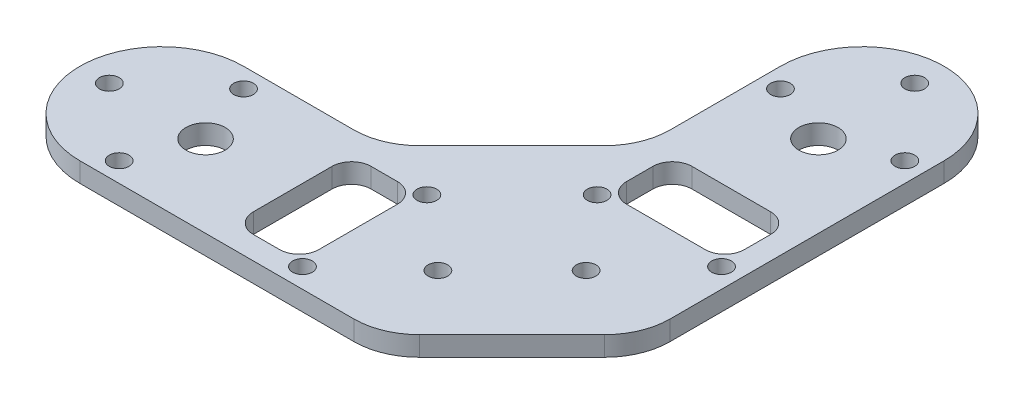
ISO-10303-21;
HEADER;
FILE_DESCRIPTION(('STEP AP214'),'2;1');
FILE_NAME('part.step','',(''),(''),'','','');
FILE_SCHEMA(('AUTOMOTIVE_DESIGN { 1 0 10303 214 1 1 1 1 }'));
ENDSEC;
DATA;
#1=APPLICATION_CONTEXT('core data for automotive mechanical design processes');
#2=APPLICATION_PROTOCOL_DEFINITION('international standard','automotive_design',2000,#1);
#3=PRODUCT_CONTEXT('',#1,'mechanical');
#4=PRODUCT('Part','Part','',(#3));
#5=PRODUCT_RELATED_PRODUCT_CATEGORY('part','',(#4));
#6=PRODUCT_DEFINITION_FORMATION('','',#4);
#7=PRODUCT_DEFINITION_CONTEXT('part definition',#1,'design');
#8=PRODUCT_DEFINITION('design','',#6,#7);
#9=PRODUCT_DEFINITION_SHAPE('','',#8);
#10=(LENGTH_UNIT() NAMED_UNIT(*) SI_UNIT(.MILLI.,.METRE.));
#11=(NAMED_UNIT(*) PLANE_ANGLE_UNIT() SI_UNIT($,.RADIAN.));
#12=(NAMED_UNIT(*) SI_UNIT($,.STERADIAN.) SOLID_ANGLE_UNIT());
#13=UNCERTAINTY_MEASURE_WITH_UNIT(LENGTH_MEASURE(1.E-05),#10,'distance_accuracy_value','');
#14=(GEOMETRIC_REPRESENTATION_CONTEXT(3) GLOBAL_UNCERTAINTY_ASSIGNED_CONTEXT((#13)) GLOBAL_UNIT_ASSIGNED_CONTEXT((#10,
#11,#12)) REPRESENTATION_CONTEXT('',''));
#15=CARTESIAN_POINT('',(0.,0.,0.));
#16=DIRECTION('',(0.,0.,1.));
#17=DIRECTION('',(1.,0.,0.));
#18=AXIS2_PLACEMENT_3D('',#15,#16,#17);
#19=CARTESIAN_POINT('',(66.,3.,0.));
#20=DIRECTION('',(0.,0.,-1.));
#21=DIRECTION('',(-1.,0.,0.));
#22=AXIS2_PLACEMENT_3D('',#19,#20,#21);
#23=PLANE('',#22);
#24=DIRECTION('',(1.,0.,0.));
#25=VECTOR('',#24,1.);
#26=CARTESIAN_POINT('',(66.,0.,0.));
#27=LINE('',#26,#25);
#28=CARTESIAN_POINT('',(0.,0.,0.));
#29=VERTEX_POINT('',#28);
#30=CARTESIAN_POINT('',(41.857864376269,0.,0.));
#31=VERTEX_POINT('',#30);
#32=EDGE_CURVE('E443',#29,#31,#27,.T.);
#33=ORIENTED_EDGE('',*,*,#32,.T.);
#34=DIRECTION('',(0.,-1.,0.));
#35=VECTOR('',#34,1.);
#36=CARTESIAN_POINT('',(41.857864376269,3.,0.));
#37=LINE('',#36,#35);
#38=CARTESIAN_POINT('',(41.857864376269,3.,0.));
#39=VERTEX_POINT('',#38);
#40=EDGE_CURVE('E490',#31,#39,#37,.F.);
#41=ORIENTED_EDGE('',*,*,#40,.T.);
#42=DIRECTION('',(1.,0.,0.));
#43=VECTOR('',#42,1.);
#44=CARTESIAN_POINT('',(66.,3.,0.));
#45=LINE('',#44,#43);
#46=CARTESIAN_POINT('',(0.,3.,0.));
#47=VERTEX_POINT('',#46);
#48=EDGE_CURVE('E446',#47,#39,#45,.T.);
#49=ORIENTED_EDGE('',*,*,#48,.F.);
#50=DIRECTION('',(0.,-1.,0.));
#51=VECTOR('',#50,1.);
#52=CARTESIAN_POINT('',(0.,3.,0.));
#53=LINE('',#52,#51);
#54=EDGE_CURVE('E454',#47,#29,#53,.T.);
#55=ORIENTED_EDGE('',*,*,#54,.T.);
#56=EDGE_LOOP('',(#33,#41,#49,#55));
#57=FACE_BOUND('',#56,.T.);
#58=ADVANCED_FACE('F35',(#57),#23,.F.);
#59=CARTESIAN_POINT('',(66.,3.,-66.));
#60=DIRECTION('',(-1.,0.,0.));
#61=DIRECTION('',(0.,0.,1.));
#62=AXIS2_PLACEMENT_3D('',#59,#60,#61);
#63=PLANE('',#62);
#64=DIRECTION('',(0.,0.,-1.));
#65=VECTOR('',#64,1.);
#66=CARTESIAN_POINT('',(66.,3.,-66.));
#67=LINE('',#66,#65);
#68=CARTESIAN_POINT('',(66.,3.,-24.142135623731));
#69=VERTEX_POINT('',#68);
#70=CARTESIAN_POINT('',(66.,3.,-66.));
#71=VERTEX_POINT('',#70);
#72=EDGE_CURVE('E449',#69,#71,#67,.T.);
#73=ORIENTED_EDGE('',*,*,#72,.F.);
#74=DIRECTION('',(0.,1.,0.));
#75=VECTOR('',#74,1.);
#76=CARTESIAN_POINT('',(66.,0.,-24.142135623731));
#77=LINE('',#76,#75);
#78=CARTESIAN_POINT('',(66.,0.,-24.142135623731));
#79=VERTEX_POINT('',#78);
#80=EDGE_CURVE('E475',#69,#79,#77,.F.);
#81=ORIENTED_EDGE('',*,*,#80,.T.);
#82=DIRECTION('',(0.,0.,-1.));
#83=VECTOR('',#82,1.);
#84=CARTESIAN_POINT('',(66.,0.,-66.));
#85=LINE('',#84,#83);
#86=CARTESIAN_POINT('',(66.,0.,-66.));
#87=VERTEX_POINT('',#86);
#88=EDGE_CURVE('E231',#79,#87,#85,.T.);
#89=ORIENTED_EDGE('',*,*,#88,.T.);
#90=DIRECTION('',(0.,-1.,0.));
#91=VECTOR('',#90,1.);
#92=CARTESIAN_POINT('',(66.,3.,-66.));
#93=LINE('',#92,#91);
#94=EDGE_CURVE('E241',#71,#87,#93,.T.);
#95=ORIENTED_EDGE('',*,*,#94,.F.);
#96=EDGE_LOOP('',(#73,#81,#89,#95));
#97=FACE_BOUND('',#96,.T.);
#98=ADVANCED_FACE('F528',(#97),#63,.F.);
#99=CARTESIAN_POINT('',(41.,3.,-25.));
#100=DIRECTION('',(1.,0.,0.));
#101=DIRECTION('',(0.,0.,-1.));
#102=AXIS2_PLACEMENT_3D('',#99,#100,#101);
#103=PLANE('',#102);
#104=DIRECTION('',(0.,0.,1.));
#105=VECTOR('',#104,1.);
#106=CARTESIAN_POINT('',(41.,0.,-25.));
#107=LINE('',#106,#105);
#108=CARTESIAN_POINT('',(41.,0.,-66.));
#109=VERTEX_POINT('',#108);
#110=CARTESIAN_POINT('',(41.,0.,-49.1421356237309));
#111=VERTEX_POINT('',#110);
#112=EDGE_CURVE('E219',#109,#111,#107,.T.);
#113=ORIENTED_EDGE('',*,*,#112,.T.);
#114=DIRECTION('',(0.,-1.,0.));
#115=VECTOR('',#114,1.);
#116=CARTESIAN_POINT('',(41.,3.,-49.1421356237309));
#117=LINE('',#116,#115);
#118=CARTESIAN_POINT('',(41.,3.,-49.1421356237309));
#119=VERTEX_POINT('',#118);
#120=EDGE_CURVE('E500',#111,#119,#117,.F.);
#121=ORIENTED_EDGE('',*,*,#120,.T.);
#122=DIRECTION('',(0.,0.,1.));
#123=VECTOR('',#122,1.);
#124=CARTESIAN_POINT('',(41.,3.,-25.));
#125=LINE('',#124,#123);
#126=CARTESIAN_POINT('',(41.,3.,-66.));
#127=VERTEX_POINT('',#126);
#128=EDGE_CURVE('E237',#127,#119,#125,.T.);
#129=ORIENTED_EDGE('',*,*,#128,.F.);
#130=DIRECTION('',(0.,-1.,0.));
#131=VECTOR('',#130,1.);
#132=CARTESIAN_POINT('',(41.,3.,-66.));
#133=LINE('',#132,#131);
#134=EDGE_CURVE('E234',#127,#109,#133,.T.);
#135=ORIENTED_EDGE('',*,*,#134,.T.);
#136=EDGE_LOOP('',(#113,#121,#129,#135));
#137=FACE_BOUND('',#136,.T.);
#138=ADVANCED_FACE('F235',(#137),#103,.F.);
#139=CARTESIAN_POINT('',(0.,3.,-25.));
#140=DIRECTION('',(0.,0.,1.));
#141=DIRECTION('',(1.,0.,0.));
#142=AXIS2_PLACEMENT_3D('',#139,#140,#141);
#143=PLANE('',#142);
#144=DIRECTION('',(-1.,0.,0.));
#145=VECTOR('',#144,1.);
#146=CARTESIAN_POINT('',(0.,3.,-25.));
#147=LINE('',#146,#145);
#148=CARTESIAN_POINT('',(16.8578643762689,3.,-25.));
#149=VERTEX_POINT('',#148);
#150=CARTESIAN_POINT('',(0.,3.,-25.));
#151=VERTEX_POINT('',#150);
#152=EDGE_CURVE('E452',#149,#151,#147,.T.);
#153=ORIENTED_EDGE('',*,*,#152,.F.);
#154=DIRECTION('',(0.,1.,0.));
#155=VECTOR('',#154,1.);
#156=CARTESIAN_POINT('',(16.8578643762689,0.,-25.));
#157=LINE('',#156,#155);
#158=CARTESIAN_POINT('',(16.8578643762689,0.,-25.));
#159=VERTEX_POINT('',#158);
#160=EDGE_CURVE('E493',#149,#159,#157,.F.);
#161=ORIENTED_EDGE('',*,*,#160,.T.);
#162=DIRECTION('',(-1.,0.,0.));
#163=VECTOR('',#162,1.);
#164=CARTESIAN_POINT('',(0.,0.,-25.));
#165=LINE('',#164,#163);
#166=CARTESIAN_POINT('',(0.,0.,-25.));
#167=VERTEX_POINT('',#166);
#168=EDGE_CURVE('E230',#159,#167,#165,.T.);
#169=ORIENTED_EDGE('',*,*,#168,.T.);
#170=DIRECTION('',(0.,-1.,0.));
#171=VECTOR('',#170,1.);
#172=CARTESIAN_POINT('',(0.,3.,-25.));
#173=LINE('',#172,#171);
#174=EDGE_CURVE('E242',#151,#167,#173,.T.);
#175=ORIENTED_EDGE('',*,*,#174,.F.);
#176=EDGE_LOOP('',(#153,#161,#169,#175));
#177=FACE_BOUND('',#176,.T.);
#178=ADVANCED_FACE('F565',(#177),#143,.F.);
#179=CARTESIAN_POINT('',(0.,3.,0.));
#180=DIRECTION('',(0.,-1.,0.));
#181=DIRECTION('',(0.,0.,-1.));
#182=AXIS2_PLACEMENT_3D('',#179,#180,#181);
#183=PLANE('',#182);
#184=CARTESIAN_POINT('',(-8.,3.,-12.5));
#185=DIRECTION('',(0.,1.,0.));
#186=DIRECTION('',(0.,0.,1.));
#187=AXIS2_PLACEMENT_3D('',#184,#185,#186);
#188=CIRCLE('',#187,1.5);
#189=CARTESIAN_POINT('',(-8.,3.,-11.));
#190=VERTEX_POINT('',#189);
#191=EDGE_CURVE('E708',#190,#190,#188,.T.);
#192=ORIENTED_EDGE('',*,*,#191,.F.);
#193=EDGE_LOOP('',(#192));
#194=FACE_BOUND('',#193,.T.);
#195=CARTESIAN_POINT('',(41.857864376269,3.,-12.8284271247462));
#196=DIRECTION('',(0.,1.,0.));
#197=DIRECTION('',(0.,0.,1.));
#198=AXIS2_PLACEMENT_3D('',#195,#196,#197);
#199=CIRCLE('',#198,1.5);
#200=CARTESIAN_POINT('',(41.857864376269,3.,-11.3284271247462));
#201=VERTEX_POINT('',#200);
#202=EDGE_CURVE('E713',#201,#201,#199,.T.);
#203=ORIENTED_EDGE('',*,*,#202,.F.);
#204=EDGE_LOOP('',(#203));
#205=FACE_BOUND('',#204,.T.);
#206=CARTESIAN_POINT('',(53.1715728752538,3.,-24.1421356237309));
#207=DIRECTION('',(0.,1.,0.));
#208=DIRECTION('',(0.,0.,1.));
#209=AXIS2_PLACEMENT_3D('',#206,#207,#208);
#210=CIRCLE('',#209,1.5);
#211=CARTESIAN_POINT('',(53.1715728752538,3.,-22.6421356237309));
#212=VERTEX_POINT('',#211);
#213=EDGE_CURVE('E721',#212,#212,#210,.T.);
#214=ORIENTED_EDGE('',*,*,#213,.F.);
#215=EDGE_LOOP('',(#214));
#216=FACE_BOUND('',#215,.T.);
#217=CARTESIAN_POINT('',(53.5,3.,-74.));
#218=DIRECTION('',(0.,1.,0.));
#219=DIRECTION('',(0.,0.,1.));
#220=AXIS2_PLACEMENT_3D('',#217,#218,#219);
#221=CIRCLE('',#220,1.5);
#222=CARTESIAN_POINT('',(53.5,3.,-72.5));
#223=VERTEX_POINT('',#222);
#224=EDGE_CURVE('E256',#223,#223,#221,.T.);
#225=ORIENTED_EDGE('',*,*,#224,.F.);
#226=EDGE_LOOP('',(#225));
#227=FACE_BOUND('',#226,.T.);
#228=DIRECTION('',(1.,0.,0.));
#229=VECTOR('',#228,1.);
#230=CARTESIAN_POINT('',(23.,3.,-3.5));
#231=LINE('',#230,#229);
#232=CARTESIAN_POINT('',(23.,3.,-3.5));
#233=VERTEX_POINT('',#232);
#234=CARTESIAN_POINT('',(27.,3.,-3.5));
#235=VERTEX_POINT('',#234);
#236=EDGE_CURVE('E288',#233,#235,#231,.T.);
#237=ORIENTED_EDGE('',*,*,#236,.F.);
#238=CARTESIAN_POINT('',(23.,3.,-6.5));
#239=DIRECTION('',(0.,1.,0.));
#240=DIRECTION('',(0.,0.,1.));
#241=AXIS2_PLACEMENT_3D('',#238,#239,#240);
#242=CIRCLE('',#241,3.);
#243=CARTESIAN_POINT('',(20.,3.,-6.5));
#244=VERTEX_POINT('',#243);
#245=EDGE_CURVE('E50',#244,#233,#242,.T.);
#246=ORIENTED_EDGE('',*,*,#245,.F.);
#247=DIRECTION('',(0.,0.,1.));
#248=VECTOR('',#247,1.);
#249=CARTESIAN_POINT('',(20.,3.,-18.5));
#250=LINE('',#249,#248);
#251=CARTESIAN_POINT('',(20.,3.,-18.5));
#252=VERTEX_POINT('',#251);
#253=EDGE_CURVE('E265',#252,#244,#250,.T.);
#254=ORIENTED_EDGE('',*,*,#253,.F.);
#255=CARTESIAN_POINT('',(23.,3.,-18.5));
#256=DIRECTION('',(0.,1.,0.));
#257=DIRECTION('',(0.,0.,1.));
#258=AXIS2_PLACEMENT_3D('',#255,#256,#257);
#259=CIRCLE('',#258,3.);
#260=CARTESIAN_POINT('',(23.,3.,-21.5));
#261=VERTEX_POINT('',#260);
#262=EDGE_CURVE('E304',#261,#252,#259,.T.);
#263=ORIENTED_EDGE('',*,*,#262,.F.);
#264=DIRECTION('',(-1.,0.,0.));
#265=VECTOR('',#264,1.);
#266=CARTESIAN_POINT('',(23.,3.,-21.5));
#267=LINE('',#266,#265);
#268=CARTESIAN_POINT('',(27.,3.,-21.5));
#269=VERTEX_POINT('',#268);
#270=EDGE_CURVE('E301',#269,#261,#267,.T.);
#271=ORIENTED_EDGE('',*,*,#270,.F.);
#272=CARTESIAN_POINT('',(27.,3.,-18.5));
#273=DIRECTION('',(0.,1.,0.));
#274=DIRECTION('',(0.,0.,-1.));
#275=AXIS2_PLACEMENT_3D('',#272,#273,#274);
#276=CIRCLE('',#275,3.);
#277=CARTESIAN_POINT('',(30.,3.,-18.5));
#278=VERTEX_POINT('',#277);
#279=EDGE_CURVE('E298',#278,#269,#276,.T.);
#280=ORIENTED_EDGE('',*,*,#279,.F.);
#281=DIRECTION('',(0.,0.,-1.));
#282=VECTOR('',#281,1.);
#283=CARTESIAN_POINT('',(30.,3.,-18.5));
#284=LINE('',#283,#282);
#285=CARTESIAN_POINT('',(30.,3.,-6.5));
#286=VERTEX_POINT('',#285);
#287=EDGE_CURVE('E295',#286,#278,#284,.T.);
#288=ORIENTED_EDGE('',*,*,#287,.F.);
#289=CARTESIAN_POINT('',(27.,3.,-6.5));
#290=DIRECTION('',(0.,1.,0.));
#291=DIRECTION('',(0.,0.,1.));
#292=AXIS2_PLACEMENT_3D('',#289,#290,#291);
#293=CIRCLE('',#292,3.);
#294=EDGE_CURVE('E292',#235,#286,#293,.T.);
#295=ORIENTED_EDGE('',*,*,#294,.F.);
#296=EDGE_LOOP('',(#237,#246,#254,#263,#271,#280,#288,#295));
#297=FACE_BOUND('',#296,.T.);
#298=CARTESIAN_POINT('',(53.5,3.,-59.3));
#299=DIRECTION('',(0.,1.,0.));
#300=DIRECTION('',(0.,0.,1.));
#301=AXIS2_PLACEMENT_3D('',#298,#299,#300);
#302=CIRCLE('',#301,3.);
#303=CARTESIAN_POINT('',(53.5,3.,-56.3));
#304=VERTEX_POINT('',#303);
#305=EDGE_CURVE('E327',#304,#304,#302,.T.);
#306=ORIENTED_EDGE('',*,*,#305,.F.);
#307=EDGE_LOOP('',(#306));
#308=FACE_BOUND('',#307,.T.);
#309=DIRECTION('',(0.,0.,1.));
#310=VECTOR('',#309,1.);
#311=CARTESIAN_POINT('',(44.5,3.,-43.));
#312=LINE('',#311,#310);
#313=CARTESIAN_POINT('',(44.5,3.,-43.));
#314=VERTEX_POINT('',#313);
#315=CARTESIAN_POINT('',(44.5,3.,-39.));
#316=VERTEX_POINT('',#315);
#317=EDGE_CURVE('E358',#314,#316,#312,.T.);
#318=ORIENTED_EDGE('',*,*,#317,.F.);
#319=CARTESIAN_POINT('',(47.5,3.,-43.));
#320=DIRECTION('',(0.,1.,0.));
#321=DIRECTION('',(0.,0.,1.));
#322=AXIS2_PLACEMENT_3D('',#319,#320,#321);
#323=CIRCLE('',#322,3.);
#324=CARTESIAN_POINT('',(47.5,3.,-46.));
#325=VERTEX_POINT('',#324);
#326=EDGE_CURVE('E58',#325,#314,#323,.T.);
#327=ORIENTED_EDGE('',*,*,#326,.F.);
#328=DIRECTION('',(-1.,0.,0.));
#329=VECTOR('',#328,1.);
#330=CARTESIAN_POINT('',(47.5,3.,-46.));
#331=LINE('',#330,#329);
#332=CARTESIAN_POINT('',(59.5,3.,-46.));
#333=VERTEX_POINT('',#332);
#334=EDGE_CURVE('E335',#333,#325,#331,.T.);
#335=ORIENTED_EDGE('',*,*,#334,.F.);
#336=CARTESIAN_POINT('',(59.5,3.,-43.));
#337=DIRECTION('',(0.,1.,0.));
#338=DIRECTION('',(0.,0.,-1.));
#339=AXIS2_PLACEMENT_3D('',#336,#337,#338);
#340=CIRCLE('',#339,3.);
#341=CARTESIAN_POINT('',(62.5,3.,-43.));
#342=VERTEX_POINT('',#341);
#343=EDGE_CURVE('E373',#342,#333,#340,.T.);
#344=ORIENTED_EDGE('',*,*,#343,.F.);
#345=DIRECTION('',(0.,0.,-1.));
#346=VECTOR('',#345,1.);
#347=CARTESIAN_POINT('',(62.5,3.,-43.));
#348=LINE('',#347,#346);
#349=CARTESIAN_POINT('',(62.5,3.,-39.));
#350=VERTEX_POINT('',#349);
#351=EDGE_CURVE('E370',#350,#342,#348,.T.);
#352=ORIENTED_EDGE('',*,*,#351,.F.);
#353=CARTESIAN_POINT('',(59.5,3.,-39.));
#354=DIRECTION('',(0.,1.,0.));
#355=DIRECTION('',(0.,0.,1.));
#356=AXIS2_PLACEMENT_3D('',#353,#354,#355);
#357=CIRCLE('',#356,3.);
#358=CARTESIAN_POINT('',(59.5,3.,-36.));
#359=VERTEX_POINT('',#358);
#360=EDGE_CURVE('E367',#359,#350,#357,.T.);
#361=ORIENTED_EDGE('',*,*,#360,.F.);
#362=DIRECTION('',(1.,0.,0.));
#363=VECTOR('',#362,1.);
#364=CARTESIAN_POINT('',(47.5,3.,-36.));
#365=LINE('',#364,#363);
#366=CARTESIAN_POINT('',(47.5,3.,-36.));
#367=VERTEX_POINT('',#366);
#368=EDGE_CURVE('E364',#367,#359,#365,.T.);
#369=ORIENTED_EDGE('',*,*,#368,.F.);
#370=CARTESIAN_POINT('',(47.5,3.,-39.));
#371=DIRECTION('',(0.,1.,0.));
#372=DIRECTION('',(0.,0.,1.));
#373=AXIS2_PLACEMENT_3D('',#370,#371,#372);
#374=CIRCLE('',#373,3.);
#375=EDGE_CURVE('E361',#316,#367,#374,.T.);
#376=ORIENTED_EDGE('',*,*,#375,.F.);
#377=EDGE_LOOP('',(#318,#327,#335,#344,#352,#361,#369,#376));
#378=FACE_BOUND('',#377,.T.);
#379=CARTESIAN_POINT('',(6.7,3.,-12.5));
#380=DIRECTION('',(0.,1.,0.));
#381=DIRECTION('',(0.,0.,1.));
#382=AXIS2_PLACEMENT_3D('',#379,#380,#381);
#383=CIRCLE('',#382,3.);
#384=CARTESIAN_POINT('',(6.7,3.,-9.5));
#385=VERTEX_POINT('',#384);
#386=EDGE_CURVE('E311',#385,#385,#383,.T.);
#387=ORIENTED_EDGE('',*,*,#386,.F.);
#388=EDGE_LOOP('',(#387));
#389=FACE_BOUND('',#388,.T.);
#390=CARTESIAN_POINT('',(3.,3.,-3.));
#391=DIRECTION('',(0.,1.,0.));
#392=DIRECTION('',(0.,0.,1.));
#393=AXIS2_PLACEMENT_3D('',#390,#391,#392);
#394=CIRCLE('',#393,1.5);
#395=CARTESIAN_POINT('',(3.,3.,-1.5));
#396=VERTEX_POINT('',#395);
#397=EDGE_CURVE('E402',#396,#396,#394,.T.);
#398=ORIENTED_EDGE('',*,*,#397,.F.);
#399=EDGE_LOOP('',(#398));
#400=FACE_BOUND('',#399,.T.);
#401=CARTESIAN_POINT('',(31.,3.,-3.));
#402=DIRECTION('',(0.,1.,0.));
#403=DIRECTION('',(0.,0.,1.));
#404=AXIS2_PLACEMENT_3D('',#401,#402,#403);
#405=CIRCLE('',#404,1.5);
#406=CARTESIAN_POINT('',(31.,3.,-1.5));
#407=VERTEX_POINT('',#406);
#408=EDGE_CURVE('E408',#407,#407,#405,.T.);
#409=ORIENTED_EDGE('',*,*,#408,.F.);
#410=EDGE_LOOP('',(#409));
#411=FACE_BOUND('',#410,.T.);
#412=CARTESIAN_POINT('',(31.,3.,-22.));
#413=DIRECTION('',(0.,1.,0.));
#414=DIRECTION('',(0.,0.,1.));
#415=AXIS2_PLACEMENT_3D('',#412,#413,#414);
#416=CIRCLE('',#415,1.5);
#417=CARTESIAN_POINT('',(31.,3.,-20.5));
#418=VERTEX_POINT('',#417);
#419=EDGE_CURVE('E414',#418,#418,#416,.T.);
#420=ORIENTED_EDGE('',*,*,#419,.F.);
#421=EDGE_LOOP('',(#420));
#422=FACE_BOUND('',#421,.T.);
#423=CARTESIAN_POINT('',(44.,3.,-35.));
#424=DIRECTION('',(0.,1.,0.));
#425=DIRECTION('',(0.,0.,1.));
#426=AXIS2_PLACEMENT_3D('',#423,#424,#425);
#427=CIRCLE('',#426,1.5);
#428=CARTESIAN_POINT('',(44.,3.,-33.5));
#429=VERTEX_POINT('',#428);
#430=EDGE_CURVE('E420',#429,#429,#427,.T.);
#431=ORIENTED_EDGE('',*,*,#430,.F.);
#432=EDGE_LOOP('',(#431));
#433=FACE_BOUND('',#432,.T.);
#434=CARTESIAN_POINT('',(63.,3.,-35.));
#435=DIRECTION('',(0.,1.,0.));
#436=DIRECTION('',(0.,0.,1.));
#437=AXIS2_PLACEMENT_3D('',#434,#435,#436);
#438=CIRCLE('',#437,1.5);
#439=CARTESIAN_POINT('',(63.,3.,-33.5));
#440=VERTEX_POINT('',#439);
#441=EDGE_CURVE('E426',#440,#440,#438,.T.);
#442=ORIENTED_EDGE('',*,*,#441,.F.);
#443=EDGE_LOOP('',(#442));
#444=FACE_BOUND('',#443,.T.);
#445=CARTESIAN_POINT('',(63.,3.,-63.));
#446=DIRECTION('',(0.,1.,0.));
#447=DIRECTION('',(0.,0.,1.));
#448=AXIS2_PLACEMENT_3D('',#445,#446,#447);
#449=CIRCLE('',#448,1.5);
#450=CARTESIAN_POINT('',(63.,3.,-61.5));
#451=VERTEX_POINT('',#450);
#452=EDGE_CURVE('E432',#451,#451,#449,.T.);
#453=ORIENTED_EDGE('',*,*,#452,.F.);
#454=EDGE_LOOP('',(#453));
#455=FACE_BOUND('',#454,.T.);
#456=CARTESIAN_POINT('',(44.,3.,-63.));
#457=DIRECTION('',(0.,1.,0.));
#458=DIRECTION('',(0.,0.,1.));
#459=AXIS2_PLACEMENT_3D('',#456,#457,#458);
#460=CIRCLE('',#459,1.5);
#461=CARTESIAN_POINT('',(44.,3.,-61.5));
#462=VERTEX_POINT('',#461);
#463=EDGE_CURVE('E395',#462,#462,#460,.T.);
#464=ORIENTED_EDGE('',*,*,#463,.F.);
#465=EDGE_LOOP('',(#464));
#466=FACE_BOUND('',#465,.T.);
#467=CARTESIAN_POINT('',(3.,3.,-22.));
#468=DIRECTION('',(0.,1.,0.));
#469=DIRECTION('',(0.,0.,1.));
#470=AXIS2_PLACEMENT_3D('',#467,#468,#469);
#471=CIRCLE('',#470,1.5);
#472=CARTESIAN_POINT('',(3.,3.,-20.5));
#473=VERTEX_POINT('',#472);
#474=EDGE_CURVE('E401',#473,#473,#471,.T.);
#475=ORIENTED_EDGE('',*,*,#474,.F.);
#476=EDGE_LOOP('',(#475));
#477=FACE_BOUND('',#476,.T.);
#478=DIRECTION('',(-0.707106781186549,0.,0.707106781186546));
#479=VECTOR('',#478,1.);
#480=CARTESIAN_POINT('',(66.,3.,-20.));
#481=LINE('',#480,#479);
#482=CARTESIAN_POINT('',(48.9289321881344,3.,-2.92893218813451));
#483=VERTEX_POINT('',#482);
#484=CARTESIAN_POINT('',(63.0710678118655,3.,-17.0710678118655));
#485=VERTEX_POINT('',#484);
#486=EDGE_CURVE('E467',#483,#485,#481,.F.);
#487=ORIENTED_EDGE('',*,*,#486,.T.);
#488=CARTESIAN_POINT('',(56.,3.,-24.142135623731));
#489=DIRECTION('',(0.,-1.,0.));
#490=DIRECTION('',(0.,0.,-1.));
#491=AXIS2_PLACEMENT_3D('',#488,#489,#490);
#492=CIRCLE('',#491,10.);
#493=EDGE_CURVE('E488',#485,#69,#492,.F.);
#494=ORIENTED_EDGE('',*,*,#493,.T.);
#495=ORIENTED_EDGE('',*,*,#72,.T.);
#496=CARTESIAN_POINT('',(53.5,3.,-66.));
#497=DIRECTION('',(0.,1.,0.));
#498=DIRECTION('',(0.,0.,1.));
#499=AXIS2_PLACEMENT_3D('',#496,#497,#498);
#500=CIRCLE('',#499,12.5);
#501=EDGE_CURVE('E248',#71,#127,#500,.T.);
#502=ORIENTED_EDGE('',*,*,#501,.T.);
#503=ORIENTED_EDGE('',*,*,#128,.T.);
#504=CARTESIAN_POINT('',(31.,3.,-49.1421356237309));
#505=DIRECTION('',(0.,-1.,0.));
#506=DIRECTION('',(0.,0.,-1.));
#507=AXIS2_PLACEMENT_3D('',#504,#505,#506);
#508=CIRCLE('',#507,10.);
#509=CARTESIAN_POINT('',(38.0710678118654,3.,-42.0710678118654));
#510=VERTEX_POINT('',#509);
#511=EDGE_CURVE('E43',#119,#510,#508,.T.);
#512=ORIENTED_EDGE('',*,*,#511,.T.);
#513=DIRECTION('',(0.707106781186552,0.,-0.707106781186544));
#514=VECTOR('',#513,1.);
#515=CARTESIAN_POINT('',(-2.0000000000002,3.,-2.00000000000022));
#516=LINE('',#515,#514);
#517=CARTESIAN_POINT('',(23.9289321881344,3.,-27.9289321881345));
#518=VERTEX_POINT('',#517);
#519=EDGE_CURVE('E472',#510,#518,#516,.F.);
#520=ORIENTED_EDGE('',*,*,#519,.T.);
#521=CARTESIAN_POINT('',(16.8578643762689,3.,-35.));
#522=DIRECTION('',(0.,-1.,0.));
#523=DIRECTION('',(0.,0.,-1.));
#524=AXIS2_PLACEMENT_3D('',#521,#522,#523);
#525=CIRCLE('',#524,10.);
#526=EDGE_CURVE('E504',#518,#149,#525,.T.);
#527=ORIENTED_EDGE('',*,*,#526,.T.);
#528=ORIENTED_EDGE('',*,*,#152,.T.);
#529=CARTESIAN_POINT('',(0.,3.,-12.5));
#530=DIRECTION('',(0.,1.,0.));
#531=DIRECTION('',(0.,0.,-1.));
#532=AXIS2_PLACEMENT_3D('',#529,#530,#531);
#533=CIRCLE('',#532,12.5);
#534=EDGE_CURVE('E247',#151,#47,#533,.T.);
#535=ORIENTED_EDGE('',*,*,#534,.T.);
#536=ORIENTED_EDGE('',*,*,#48,.T.);
#537=CARTESIAN_POINT('',(41.857864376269,3.,-10.));
#538=DIRECTION('',(0.,-1.,0.));
#539=DIRECTION('',(0.,0.,-1.));
#540=AXIS2_PLACEMENT_3D('',#537,#538,#539);
#541=CIRCLE('',#540,10.);
#542=EDGE_CURVE('E486',#39,#483,#541,.F.);
#543=ORIENTED_EDGE('',*,*,#542,.T.);
#544=EDGE_LOOP('',(#487,#494,#495,#502,#503,#512,#520,#527,#528,#535,#536,#543));
#545=FACE_BOUND('',#544,.T.);
#546=ADVANCED_FACE('F507',(#194,#205,#216,#227,#297,#308,#378,#389,#400,#411,#422,#433,#444,
#455,#466,#477,#545),#183,.F.);
#547=CARTESIAN_POINT('',(0.,0.,0.));
#548=DIRECTION('',(0.,-1.,0.));
#549=DIRECTION('',(0.,0.,-1.));
#550=AXIS2_PLACEMENT_3D('',#547,#548,#549);
#551=PLANE('',#550);
#552=CARTESIAN_POINT('',(-8.,0.,-12.5));
#553=DIRECTION('',(0.,1.,0.));
#554=DIRECTION('',(0.,0.,1.));
#555=AXIS2_PLACEMENT_3D('',#552,#553,#554);
#556=CIRCLE('',#555,1.5);
#557=CARTESIAN_POINT('',(-8.,0.,-11.));
#558=VERTEX_POINT('',#557);
#559=EDGE_CURVE('E705',#558,#558,#556,.T.);
#560=ORIENTED_EDGE('',*,*,#559,.T.);
#561=EDGE_LOOP('',(#560));
#562=FACE_BOUND('',#561,.T.);
#563=CARTESIAN_POINT('',(41.857864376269,0.,-12.8284271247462));
#564=DIRECTION('',(0.,1.,0.));
#565=DIRECTION('',(0.,0.,1.));
#566=AXIS2_PLACEMENT_3D('',#563,#564,#565);
#567=CIRCLE('',#566,1.5);
#568=CARTESIAN_POINT('',(41.857864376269,0.,-11.3284271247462));
#569=VERTEX_POINT('',#568);
#570=EDGE_CURVE('E709',#569,#569,#567,.T.);
#571=ORIENTED_EDGE('',*,*,#570,.T.);
#572=EDGE_LOOP('',(#571));
#573=FACE_BOUND('',#572,.T.);
#574=CARTESIAN_POINT('',(53.1715728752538,0.,-24.1421356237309));
#575=DIRECTION('',(0.,1.,0.));
#576=DIRECTION('',(0.,0.,1.));
#577=AXIS2_PLACEMENT_3D('',#574,#575,#576);
#578=CIRCLE('',#577,1.5);
#579=CARTESIAN_POINT('',(53.1715728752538,0.,-22.6421356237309));
#580=VERTEX_POINT('',#579);
#581=EDGE_CURVE('E718',#580,#580,#578,.T.);
#582=ORIENTED_EDGE('',*,*,#581,.T.);
#583=EDGE_LOOP('',(#582));
#584=FACE_BOUND('',#583,.T.);
#585=CARTESIAN_POINT('',(53.5,0.,-74.));
#586=DIRECTION('',(0.,1.,0.));
#587=DIRECTION('',(0.,0.,1.));
#588=AXIS2_PLACEMENT_3D('',#585,#586,#587);
#589=CIRCLE('',#588,1.5);
#590=CARTESIAN_POINT('',(53.5,0.,-72.5));
#591=VERTEX_POINT('',#590);
#592=EDGE_CURVE('E253',#591,#591,#589,.T.);
#593=ORIENTED_EDGE('',*,*,#592,.T.);
#594=EDGE_LOOP('',(#593));
#595=FACE_BOUND('',#594,.T.);
#596=CARTESIAN_POINT('',(23.,0.,-6.5));
#597=DIRECTION('',(0.,1.,0.));
#598=DIRECTION('',(0.,0.,1.));
#599=AXIS2_PLACEMENT_3D('',#596,#597,#598);
#600=CIRCLE('',#599,3.);
#601=CARTESIAN_POINT('',(20.,0.,-6.5));
#602=VERTEX_POINT('',#601);
#603=CARTESIAN_POINT('',(23.,0.,-3.5));
#604=VERTEX_POINT('',#603);
#605=EDGE_CURVE('E261',#602,#604,#600,.T.);
#606=ORIENTED_EDGE('',*,*,#605,.T.);
#607=DIRECTION('',(1.,0.,0.));
#608=VECTOR('',#607,1.);
#609=CARTESIAN_POINT('',(23.,0.,-3.5));
#610=LINE('',#609,#608);
#611=CARTESIAN_POINT('',(27.,0.,-3.5));
#612=VERTEX_POINT('',#611);
#613=EDGE_CURVE('E264',#604,#612,#610,.T.);
#614=ORIENTED_EDGE('',*,*,#613,.T.);
#615=CARTESIAN_POINT('',(27.,0.,-6.5));
#616=DIRECTION('',(0.,1.,0.));
#617=DIRECTION('',(0.,0.,1.));
#618=AXIS2_PLACEMENT_3D('',#615,#616,#617);
#619=CIRCLE('',#618,3.);
#620=CARTESIAN_POINT('',(30.,0.,-6.5));
#621=VERTEX_POINT('',#620);
#622=EDGE_CURVE('E268',#612,#621,#619,.T.);
#623=ORIENTED_EDGE('',*,*,#622,.T.);
#624=DIRECTION('',(0.,0.,-1.));
#625=VECTOR('',#624,1.);
#626=CARTESIAN_POINT('',(30.,0.,-18.5));
#627=LINE('',#626,#625);
#628=CARTESIAN_POINT('',(30.,0.,-18.5));
#629=VERTEX_POINT('',#628);
#630=EDGE_CURVE('E271',#621,#629,#627,.T.);
#631=ORIENTED_EDGE('',*,*,#630,.T.);
#632=CARTESIAN_POINT('',(27.,0.,-18.5));
#633=DIRECTION('',(0.,1.,0.));
#634=DIRECTION('',(0.,0.,-1.));
#635=AXIS2_PLACEMENT_3D('',#632,#633,#634);
#636=CIRCLE('',#635,3.);
#637=CARTESIAN_POINT('',(27.,0.,-21.5));
#638=VERTEX_POINT('',#637);
#639=EDGE_CURVE('E274',#629,#638,#636,.T.);
#640=ORIENTED_EDGE('',*,*,#639,.T.);
#641=DIRECTION('',(-1.,0.,0.));
#642=VECTOR('',#641,1.);
#643=CARTESIAN_POINT('',(23.,0.,-21.5));
#644=LINE('',#643,#642);
#645=CARTESIAN_POINT('',(23.,0.,-21.5));
#646=VERTEX_POINT('',#645);
#647=EDGE_CURVE('E277',#638,#646,#644,.T.);
#648=ORIENTED_EDGE('',*,*,#647,.T.);
#649=CARTESIAN_POINT('',(23.,0.,-18.5));
#650=DIRECTION('',(0.,1.,0.));
#651=DIRECTION('',(0.,0.,1.));
#652=AXIS2_PLACEMENT_3D('',#649,#650,#651);
#653=CIRCLE('',#652,3.);
#654=CARTESIAN_POINT('',(20.,0.,-18.5));
#655=VERTEX_POINT('',#654);
#656=EDGE_CURVE('E280',#646,#655,#653,.T.);
#657=ORIENTED_EDGE('',*,*,#656,.T.);
#658=DIRECTION('',(0.,0.,1.));
#659=VECTOR('',#658,1.);
#660=CARTESIAN_POINT('',(20.,0.,-18.5));
#661=LINE('',#660,#659);
#662=EDGE_CURVE('E283',#655,#602,#661,.T.);
#663=ORIENTED_EDGE('',*,*,#662,.T.);
#664=EDGE_LOOP('',(#606,#614,#623,#631,#640,#648,#657,#663));
#665=FACE_BOUND('',#664,.T.);
#666=CARTESIAN_POINT('',(53.5,0.,-59.3));
#667=DIRECTION('',(0.,1.,0.));
#668=DIRECTION('',(0.,0.,1.));
#669=AXIS2_PLACEMENT_3D('',#666,#667,#668);
#670=CIRCLE('',#669,3.);
#671=CARTESIAN_POINT('',(53.5,0.,-56.3));
#672=VERTEX_POINT('',#671);
#673=EDGE_CURVE('E289',#672,#672,#670,.T.);
#674=ORIENTED_EDGE('',*,*,#673,.T.);
#675=EDGE_LOOP('',(#674));
#676=FACE_BOUND('',#675,.T.);
#677=CARTESIAN_POINT('',(47.5,0.,-43.));
#678=DIRECTION('',(0.,1.,0.));
#679=DIRECTION('',(0.,0.,1.));
#680=AXIS2_PLACEMENT_3D('',#677,#678,#679);
#681=CIRCLE('',#680,3.);
#682=CARTESIAN_POINT('',(47.5,0.,-46.));
#683=VERTEX_POINT('',#682);
#684=CARTESIAN_POINT('',(44.5,0.,-43.));
#685=VERTEX_POINT('',#684);
#686=EDGE_CURVE('E331',#683,#685,#681,.T.);
#687=ORIENTED_EDGE('',*,*,#686,.T.);
#688=DIRECTION('',(0.,0.,1.));
#689=VECTOR('',#688,1.);
#690=CARTESIAN_POINT('',(44.5,0.,-43.));
#691=LINE('',#690,#689);
#692=CARTESIAN_POINT('',(44.5,0.,-39.));
#693=VERTEX_POINT('',#692);
#694=EDGE_CURVE('E334',#685,#693,#691,.T.);
#695=ORIENTED_EDGE('',*,*,#694,.T.);
#696=CARTESIAN_POINT('',(47.5,0.,-39.));
#697=DIRECTION('',(0.,1.,0.));
#698=DIRECTION('',(0.,0.,1.));
#699=AXIS2_PLACEMENT_3D('',#696,#697,#698);
#700=CIRCLE('',#699,3.);
#701=CARTESIAN_POINT('',(47.5,0.,-36.));
#702=VERTEX_POINT('',#701);
#703=EDGE_CURVE('E338',#693,#702,#700,.T.);
#704=ORIENTED_EDGE('',*,*,#703,.T.);
#705=DIRECTION('',(1.,0.,0.));
#706=VECTOR('',#705,1.);
#707=CARTESIAN_POINT('',(47.5,0.,-36.));
#708=LINE('',#707,#706);
#709=CARTESIAN_POINT('',(59.5,0.,-36.));
#710=VERTEX_POINT('',#709);
#711=EDGE_CURVE('E341',#702,#710,#708,.T.);
#712=ORIENTED_EDGE('',*,*,#711,.T.);
#713=CARTESIAN_POINT('',(59.5,0.,-39.));
#714=DIRECTION('',(0.,1.,0.));
#715=DIRECTION('',(0.,0.,1.));
#716=AXIS2_PLACEMENT_3D('',#713,#714,#715);
#717=CIRCLE('',#716,3.);
#718=CARTESIAN_POINT('',(62.5,0.,-39.));
#719=VERTEX_POINT('',#718);
#720=EDGE_CURVE('E344',#710,#719,#717,.T.);
#721=ORIENTED_EDGE('',*,*,#720,.T.);
#722=DIRECTION('',(0.,0.,-1.));
#723=VECTOR('',#722,1.);
#724=CARTESIAN_POINT('',(62.5,0.,-43.));
#725=LINE('',#724,#723);
#726=CARTESIAN_POINT('',(62.5,0.,-43.));
#727=VERTEX_POINT('',#726);
#728=EDGE_CURVE('E347',#719,#727,#725,.T.);
#729=ORIENTED_EDGE('',*,*,#728,.T.);
#730=CARTESIAN_POINT('',(59.5,0.,-43.));
#731=DIRECTION('',(0.,1.,0.));
#732=DIRECTION('',(0.,0.,-1.));
#733=AXIS2_PLACEMENT_3D('',#730,#731,#732);
#734=CIRCLE('',#733,3.);
#735=CARTESIAN_POINT('',(59.5,0.,-46.));
#736=VERTEX_POINT('',#735);
#737=EDGE_CURVE('E350',#727,#736,#734,.T.);
#738=ORIENTED_EDGE('',*,*,#737,.T.);
#739=DIRECTION('',(-1.,0.,0.));
#740=VECTOR('',#739,1.);
#741=CARTESIAN_POINT('',(47.5,0.,-46.));
#742=LINE('',#741,#740);
#743=EDGE_CURVE('E353',#736,#683,#742,.T.);
#744=ORIENTED_EDGE('',*,*,#743,.T.);
#745=EDGE_LOOP('',(#687,#695,#704,#712,#721,#729,#738,#744));
#746=FACE_BOUND('',#745,.T.);
#747=CARTESIAN_POINT('',(6.7,0.,-12.5));
#748=DIRECTION('',(0.,1.,0.));
#749=DIRECTION('',(0.,0.,1.));
#750=AXIS2_PLACEMENT_3D('',#747,#748,#749);
#751=CIRCLE('',#750,3.);
#752=CARTESIAN_POINT('',(6.7,0.,-9.5));
#753=VERTEX_POINT('',#752);
#754=EDGE_CURVE('E392',#753,#753,#751,.T.);
#755=ORIENTED_EDGE('',*,*,#754,.T.);
#756=EDGE_LOOP('',(#755));
#757=FACE_BOUND('',#756,.T.);
#758=CARTESIAN_POINT('',(3.,0.,-3.));
#759=DIRECTION('',(0.,1.,0.));
#760=DIRECTION('',(0.,0.,1.));
#761=AXIS2_PLACEMENT_3D('',#758,#759,#760);
#762=CIRCLE('',#761,1.5);
#763=CARTESIAN_POINT('',(3.,0.,-1.5));
#764=VERTEX_POINT('',#763);
#765=EDGE_CURVE('E398',#764,#764,#762,.T.);
#766=ORIENTED_EDGE('',*,*,#765,.T.);
#767=EDGE_LOOP('',(#766));
#768=FACE_BOUND('',#767,.T.);
#769=CARTESIAN_POINT('',(31.,0.,-3.));
#770=DIRECTION('',(0.,1.,0.));
#771=DIRECTION('',(0.,0.,1.));
#772=AXIS2_PLACEMENT_3D('',#769,#770,#771);
#773=CIRCLE('',#772,1.5);
#774=CARTESIAN_POINT('',(31.,0.,-1.5));
#775=VERTEX_POINT('',#774);
#776=EDGE_CURVE('E405',#775,#775,#773,.T.);
#777=ORIENTED_EDGE('',*,*,#776,.T.);
#778=EDGE_LOOP('',(#777));
#779=FACE_BOUND('',#778,.T.);
#780=CARTESIAN_POINT('',(31.,0.,-22.));
#781=DIRECTION('',(0.,1.,0.));
#782=DIRECTION('',(0.,0.,1.));
#783=AXIS2_PLACEMENT_3D('',#780,#781,#782);
#784=CIRCLE('',#783,1.5);
#785=CARTESIAN_POINT('',(31.,0.,-20.5));
#786=VERTEX_POINT('',#785);
#787=EDGE_CURVE('E411',#786,#786,#784,.T.);
#788=ORIENTED_EDGE('',*,*,#787,.T.);
#789=EDGE_LOOP('',(#788));
#790=FACE_BOUND('',#789,.T.);
#791=CARTESIAN_POINT('',(44.,0.,-35.));
#792=DIRECTION('',(0.,1.,0.));
#793=DIRECTION('',(0.,0.,1.));
#794=AXIS2_PLACEMENT_3D('',#791,#792,#793);
#795=CIRCLE('',#794,1.5);
#796=CARTESIAN_POINT('',(44.,0.,-33.5));
#797=VERTEX_POINT('',#796);
#798=EDGE_CURVE('E417',#797,#797,#795,.T.);
#799=ORIENTED_EDGE('',*,*,#798,.T.);
#800=EDGE_LOOP('',(#799));
#801=FACE_BOUND('',#800,.T.);
#802=CARTESIAN_POINT('',(63.,0.,-35.));
#803=DIRECTION('',(0.,1.,0.));
#804=DIRECTION('',(0.,0.,1.));
#805=AXIS2_PLACEMENT_3D('',#802,#803,#804);
#806=CIRCLE('',#805,1.5);
#807=CARTESIAN_POINT('',(63.,0.,-33.5));
#808=VERTEX_POINT('',#807);
#809=EDGE_CURVE('E423',#808,#808,#806,.T.);
#810=ORIENTED_EDGE('',*,*,#809,.T.);
#811=EDGE_LOOP('',(#810));
#812=FACE_BOUND('',#811,.T.);
#813=CARTESIAN_POINT('',(63.,0.,-63.));
#814=DIRECTION('',(0.,1.,0.));
#815=DIRECTION('',(0.,0.,1.));
#816=AXIS2_PLACEMENT_3D('',#813,#814,#815);
#817=CIRCLE('',#816,1.5);
#818=CARTESIAN_POINT('',(63.,0.,-61.5));
#819=VERTEX_POINT('',#818);
#820=EDGE_CURVE('E429',#819,#819,#817,.T.);
#821=ORIENTED_EDGE('',*,*,#820,.T.);
#822=EDGE_LOOP('',(#821));
#823=FACE_BOUND('',#822,.T.);
#824=CARTESIAN_POINT('',(44.,0.,-63.));
#825=DIRECTION('',(0.,1.,0.));
#826=DIRECTION('',(0.,0.,1.));
#827=AXIS2_PLACEMENT_3D('',#824,#825,#826);
#828=CIRCLE('',#827,1.5);
#829=CARTESIAN_POINT('',(44.,0.,-61.5));
#830=VERTEX_POINT('',#829);
#831=EDGE_CURVE('E435',#830,#830,#828,.T.);
#832=ORIENTED_EDGE('',*,*,#831,.T.);
#833=EDGE_LOOP('',(#832));
#834=FACE_BOUND('',#833,.T.);
#835=CARTESIAN_POINT('',(3.,0.,-22.));
#836=DIRECTION('',(0.,1.,0.));
#837=DIRECTION('',(0.,0.,1.));
#838=AXIS2_PLACEMENT_3D('',#835,#836,#837);
#839=CIRCLE('',#838,1.5);
#840=CARTESIAN_POINT('',(3.,0.,-20.5));
#841=VERTEX_POINT('',#840);
#842=EDGE_CURVE('E440',#841,#841,#839,.T.);
#843=ORIENTED_EDGE('',*,*,#842,.T.);
#844=EDGE_LOOP('',(#843));
#845=FACE_BOUND('',#844,.T.);
#846=ORIENTED_EDGE('',*,*,#88,.F.);
#847=CARTESIAN_POINT('',(56.,0.,-24.142135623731));
#848=DIRECTION('',(0.,-1.,0.));
#849=DIRECTION('',(0.,0.,-1.));
#850=AXIS2_PLACEMENT_3D('',#847,#848,#849);
#851=CIRCLE('',#850,10.);
#852=CARTESIAN_POINT('',(63.0710678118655,0.,-17.0710678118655));
#853=VERTEX_POINT('',#852);
#854=EDGE_CURVE('E480',#79,#853,#851,.T.);
#855=ORIENTED_EDGE('',*,*,#854,.T.);
#856=DIRECTION('',(0.707106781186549,0.,-0.707106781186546));
#857=VECTOR('',#856,1.);
#858=CARTESIAN_POINT('',(22.9999999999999,0.,23.));
#859=LINE('',#858,#857);
#860=CARTESIAN_POINT('',(48.9289321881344,0.,-2.92893218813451));
#861=VERTEX_POINT('',#860);
#862=EDGE_CURVE('E464',#853,#861,#859,.F.);
#863=ORIENTED_EDGE('',*,*,#862,.T.);
#864=CARTESIAN_POINT('',(41.857864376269,0.,-10.));
#865=DIRECTION('',(0.,-1.,0.));
#866=DIRECTION('',(0.,0.,-1.));
#867=AXIS2_PLACEMENT_3D('',#864,#865,#866);
#868=CIRCLE('',#867,10.);
#869=EDGE_CURVE('E478',#861,#31,#868,.T.);
#870=ORIENTED_EDGE('',*,*,#869,.T.);
#871=ORIENTED_EDGE('',*,*,#32,.F.);
#872=CARTESIAN_POINT('',(0.,0.,-12.5));
#873=DIRECTION('',(0.,1.,0.));
#874=DIRECTION('',(0.,0.,-1.));
#875=AXIS2_PLACEMENT_3D('',#872,#873,#874);
#876=CIRCLE('',#875,12.5);
#877=EDGE_CURVE('E251',#167,#29,#876,.T.);
#878=ORIENTED_EDGE('',*,*,#877,.F.);
#879=ORIENTED_EDGE('',*,*,#168,.F.);
#880=CARTESIAN_POINT('',(16.8578643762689,0.,-35.));
#881=DIRECTION('',(0.,-1.,0.));
#882=DIRECTION('',(0.,0.,-1.));
#883=AXIS2_PLACEMENT_3D('',#880,#881,#882);
#884=CIRCLE('',#883,10.);
#885=CARTESIAN_POINT('',(23.9289321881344,0.,-27.9289321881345));
#886=VERTEX_POINT('',#885);
#887=EDGE_CURVE('E502',#159,#886,#884,.F.);
#888=ORIENTED_EDGE('',*,*,#887,.T.);
#889=DIRECTION('',(-0.707106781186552,0.,0.707106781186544));
#890=VECTOR('',#889,1.);
#891=CARTESIAN_POINT('',(20.9999999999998,0.,-25.));
#892=LINE('',#891,#890);
#893=CARTESIAN_POINT('',(38.0710678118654,0.,-42.0710678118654));
#894=VERTEX_POINT('',#893);
#895=EDGE_CURVE('E470',#886,#894,#892,.F.);
#896=ORIENTED_EDGE('',*,*,#895,.T.);
#897=CARTESIAN_POINT('',(31.,0.,-49.1421356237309));
#898=DIRECTION('',(0.,-1.,0.));
#899=DIRECTION('',(0.,0.,-1.));
#900=AXIS2_PLACEMENT_3D('',#897,#898,#899);
#901=CIRCLE('',#900,10.);
#902=EDGE_CURVE('E11',#894,#111,#901,.F.);
#903=ORIENTED_EDGE('',*,*,#902,.T.);
#904=ORIENTED_EDGE('',*,*,#112,.F.);
#905=CARTESIAN_POINT('',(53.5,0.,-66.));
#906=DIRECTION('',(0.,1.,0.));
#907=DIRECTION('',(0.,0.,1.));
#908=AXIS2_PLACEMENT_3D('',#905,#906,#907);
#909=CIRCLE('',#908,12.5);
#910=EDGE_CURVE('E224',#87,#109,#909,.T.);
#911=ORIENTED_EDGE('',*,*,#910,.F.);
#912=EDGE_LOOP('',(#846,#855,#863,#870,#871,#878,#879,#888,#896,#903,#904,#911));
#913=FACE_BOUND('',#912,.T.);
#914=ADVANCED_FACE('F222',(#562,#573,#584,#595,#665,#676,#746,#757,#768,#779,#790,#801,#812,
#823,#834,#845,#913),#551,.T.);
#915=CARTESIAN_POINT('',(66.,3.,-20.));
#916=DIRECTION('',(-0.707106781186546,0.,-0.707106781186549));
#917=DIRECTION('',(0.,-1.,0.));
#918=AXIS2_PLACEMENT_3D('',#915,#916,#917);
#919=PLANE('',#918);
#920=ORIENTED_EDGE('',*,*,#862,.F.);
#921=DIRECTION('',(0.,-1.,0.));
#922=VECTOR('',#921,1.);
#923=CARTESIAN_POINT('',(63.0710678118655,3.,-17.0710678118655));
#924=LINE('',#923,#922);
#925=EDGE_CURVE('E484',#853,#485,#924,.F.);
#926=ORIENTED_EDGE('',*,*,#925,.T.);
#927=ORIENTED_EDGE('',*,*,#486,.F.);
#928=DIRECTION('',(0.,1.,0.));
#929=VECTOR('',#928,1.);
#930=CARTESIAN_POINT('',(48.9289321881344,0.,-2.92893218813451));
#931=LINE('',#930,#929);
#932=EDGE_CURVE('E482',#483,#861,#931,.F.);
#933=ORIENTED_EDGE('',*,*,#932,.T.);
#934=EDGE_LOOP('',(#920,#926,#927,#933));
#935=FACE_BOUND('',#934,.T.);
#936=ADVANCED_FACE('F538',(#935),#919,.F.);
#937=CARTESIAN_POINT('',(20.9999999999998,3.,-25.));
#938=DIRECTION('',(-0.707106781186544,0.,-0.707106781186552));
#939=DIRECTION('',(0.,1.,0.));
#940=AXIS2_PLACEMENT_3D('',#937,#938,#939);
#941=PLANE('',#940);
#942=ORIENTED_EDGE('',*,*,#895,.F.);
#943=DIRECTION('',(0.,-1.,0.));
#944=VECTOR('',#943,1.);
#945=CARTESIAN_POINT('',(23.9289321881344,3.,-27.9289321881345));
#946=LINE('',#945,#944);
#947=EDGE_CURVE('E498',#886,#518,#946,.F.);
#948=ORIENTED_EDGE('',*,*,#947,.T.);
#949=ORIENTED_EDGE('',*,*,#519,.F.);
#950=DIRECTION('',(0.,1.,0.));
#951=VECTOR('',#950,1.);
#952=CARTESIAN_POINT('',(38.0710678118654,0.,-42.0710678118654));
#953=LINE('',#952,#951);
#954=EDGE_CURVE('E496',#510,#894,#953,.F.);
#955=ORIENTED_EDGE('',*,*,#954,.T.);
#956=EDGE_LOOP('',(#942,#948,#949,#955));
#957=FACE_BOUND('',#956,.T.);
#958=ADVANCED_FACE('F513',(#957),#941,.T.);
#959=CARTESIAN_POINT('',(56.,3.,-24.142135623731));
#960=DIRECTION('',(0.,-1.,0.));
#961=DIRECTION('',(0.,0.,-1.));
#962=AXIS2_PLACEMENT_3D('',#959,#960,#961);
#963=CYLINDRICAL_SURFACE('',#962,10.);
#964=ORIENTED_EDGE('',*,*,#493,.F.);
#965=ORIENTED_EDGE('',*,*,#925,.F.);
#966=ORIENTED_EDGE('',*,*,#854,.F.);
#967=ORIENTED_EDGE('',*,*,#80,.F.);
#968=EDGE_LOOP('',(#964,#965,#966,#967));
#969=FACE_BOUND('',#968,.T.);
#970=ADVANCED_FACE('F544',(#969),#963,.T.);
#971=CARTESIAN_POINT('',(41.857864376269,3.,-10.));
#972=DIRECTION('',(0.,1.,0.));
#973=DIRECTION('',(0.,0.,1.));
#974=AXIS2_PLACEMENT_3D('',#971,#972,#973);
#975=CYLINDRICAL_SURFACE('',#974,10.);
#976=ORIENTED_EDGE('',*,*,#869,.F.);
#977=ORIENTED_EDGE('',*,*,#932,.F.);
#978=ORIENTED_EDGE('',*,*,#542,.F.);
#979=ORIENTED_EDGE('',*,*,#40,.F.);
#980=EDGE_LOOP('',(#976,#977,#978,#979));
#981=FACE_BOUND('',#980,.T.);
#982=ADVANCED_FACE('F525',(#981),#975,.T.);
#983=CARTESIAN_POINT('',(16.8578643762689,3.,-35.));
#984=DIRECTION('',(0.,-1.,0.));
#985=DIRECTION('',(0.,0.,-1.));
#986=AXIS2_PLACEMENT_3D('',#983,#984,#985);
#987=CYLINDRICAL_SURFACE('',#986,10.);
#988=ORIENTED_EDGE('',*,*,#526,.F.);
#989=ORIENTED_EDGE('',*,*,#947,.F.);
#990=ORIENTED_EDGE('',*,*,#887,.F.);
#991=ORIENTED_EDGE('',*,*,#160,.F.);
#992=EDGE_LOOP('',(#988,#989,#990,#991));
#993=FACE_BOUND('',#992,.T.);
#994=ADVANCED_FACE('F517',(#993),#987,.F.);
#995=CARTESIAN_POINT('',(31.,3.,-49.1421356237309));
#996=DIRECTION('',(0.,1.,0.));
#997=DIRECTION('',(0.,0.,1.));
#998=AXIS2_PLACEMENT_3D('',#995,#996,#997);
#999=CYLINDRICAL_SURFACE('',#998,10.);
#1000=ORIENTED_EDGE('',*,*,#902,.F.);
#1001=ORIENTED_EDGE('',*,*,#954,.F.);
#1002=ORIENTED_EDGE('',*,*,#511,.F.);
#1003=ORIENTED_EDGE('',*,*,#120,.F.);
#1004=EDGE_LOOP('',(#1000,#1001,#1002,#1003));
#1005=FACE_BOUND('',#1004,.T.);
#1006=ADVANCED_FACE('F37',(#1005),#999,.F.);
#1007=CARTESIAN_POINT('',(3.,0.,-22.));
#1008=DIRECTION('',(0.,1.,0.));
#1009=DIRECTION('',(0.,0.,1.));
#1010=AXIS2_PLACEMENT_3D('',#1007,#1008,#1009);
#1011=CYLINDRICAL_SURFACE('',#1010,1.5);
#1012=ORIENTED_EDGE('',*,*,#842,.F.);
#1013=EDGE_LOOP('',(#1012));
#1014=FACE_BOUND('',#1013,.T.);
#1015=ORIENTED_EDGE('',*,*,#474,.T.);
#1016=EDGE_LOOP('',(#1015));
#1017=FACE_BOUND('',#1016,.T.);
#1018=ADVANCED_FACE('F516',(#1014,#1017),#1011,.F.);
#1019=CARTESIAN_POINT('',(44.,0.,-63.));
#1020=DIRECTION('',(0.,1.,0.));
#1021=DIRECTION('',(0.,0.,1.));
#1022=AXIS2_PLACEMENT_3D('',#1019,#1020,#1021);
#1023=CYLINDRICAL_SURFACE('',#1022,1.5);
#1024=ORIENTED_EDGE('',*,*,#831,.F.);
#1025=EDGE_LOOP('',(#1024));
#1026=FACE_BOUND('',#1025,.T.);
#1027=ORIENTED_EDGE('',*,*,#463,.T.);
#1028=EDGE_LOOP('',(#1027));
#1029=FACE_BOUND('',#1028,.T.);
#1030=ADVANCED_FACE('F522',(#1026,#1029),#1023,.F.);
#1031=CARTESIAN_POINT('',(63.,0.,-63.));
#1032=DIRECTION('',(0.,1.,0.));
#1033=DIRECTION('',(0.,0.,1.));
#1034=AXIS2_PLACEMENT_3D('',#1031,#1032,#1033);
#1035=CYLINDRICAL_SURFACE('',#1034,1.5);
#1036=ORIENTED_EDGE('',*,*,#820,.F.);
#1037=EDGE_LOOP('',(#1036));
#1038=FACE_BOUND('',#1037,.T.);
#1039=ORIENTED_EDGE('',*,*,#452,.T.);
#1040=EDGE_LOOP('',(#1039));
#1041=FACE_BOUND('',#1040,.T.);
#1042=ADVANCED_FACE('F586',(#1038,#1041),#1035,.F.);
#1043=CARTESIAN_POINT('',(63.,0.,-35.));
#1044=DIRECTION('',(0.,1.,0.));
#1045=DIRECTION('',(0.,0.,1.));
#1046=AXIS2_PLACEMENT_3D('',#1043,#1044,#1045);
#1047=CYLINDRICAL_SURFACE('',#1046,1.5);
#1048=ORIENTED_EDGE('',*,*,#809,.F.);
#1049=EDGE_LOOP('',(#1048));
#1050=FACE_BOUND('',#1049,.T.);
#1051=ORIENTED_EDGE('',*,*,#441,.T.);
#1052=EDGE_LOOP('',(#1051));
#1053=FACE_BOUND('',#1052,.T.);
#1054=ADVANCED_FACE('F590',(#1050,#1053),#1047,.F.);
#1055=CARTESIAN_POINT('',(44.,0.,-35.));
#1056=DIRECTION('',(0.,1.,0.));
#1057=DIRECTION('',(0.,0.,1.));
#1058=AXIS2_PLACEMENT_3D('',#1055,#1056,#1057);
#1059=CYLINDRICAL_SURFACE('',#1058,1.5);
#1060=ORIENTED_EDGE('',*,*,#798,.F.);
#1061=EDGE_LOOP('',(#1060));
#1062=FACE_BOUND('',#1061,.T.);
#1063=ORIENTED_EDGE('',*,*,#430,.T.);
#1064=EDGE_LOOP('',(#1063));
#1065=FACE_BOUND('',#1064,.T.);
#1066=ADVANCED_FACE('F594',(#1062,#1065),#1059,.F.);
#1067=CARTESIAN_POINT('',(31.,0.,-22.));
#1068=DIRECTION('',(0.,1.,0.));
#1069=DIRECTION('',(0.,0.,1.));
#1070=AXIS2_PLACEMENT_3D('',#1067,#1068,#1069);
#1071=CYLINDRICAL_SURFACE('',#1070,1.5);
#1072=ORIENTED_EDGE('',*,*,#787,.F.);
#1073=EDGE_LOOP('',(#1072));
#1074=FACE_BOUND('',#1073,.T.);
#1075=ORIENTED_EDGE('',*,*,#419,.T.);
#1076=EDGE_LOOP('',(#1075));
#1077=FACE_BOUND('',#1076,.T.);
#1078=ADVANCED_FACE('F598',(#1074,#1077),#1071,.F.);
#1079=CARTESIAN_POINT('',(31.,0.,-3.));
#1080=DIRECTION('',(0.,1.,0.));
#1081=DIRECTION('',(0.,0.,1.));
#1082=AXIS2_PLACEMENT_3D('',#1079,#1080,#1081);
#1083=CYLINDRICAL_SURFACE('',#1082,1.5);
#1084=ORIENTED_EDGE('',*,*,#776,.F.);
#1085=EDGE_LOOP('',(#1084));
#1086=FACE_BOUND('',#1085,.T.);
#1087=ORIENTED_EDGE('',*,*,#408,.T.);
#1088=EDGE_LOOP('',(#1087));
#1089=FACE_BOUND('',#1088,.T.);
#1090=ADVANCED_FACE('F602',(#1086,#1089),#1083,.F.);
#1091=CARTESIAN_POINT('',(3.,0.,-3.));
#1092=DIRECTION('',(0.,1.,0.));
#1093=DIRECTION('',(0.,0.,1.));
#1094=AXIS2_PLACEMENT_3D('',#1091,#1092,#1093);
#1095=CYLINDRICAL_SURFACE('',#1094,1.5);
#1096=ORIENTED_EDGE('',*,*,#765,.F.);
#1097=EDGE_LOOP('',(#1096));
#1098=FACE_BOUND('',#1097,.T.);
#1099=ORIENTED_EDGE('',*,*,#397,.T.);
#1100=EDGE_LOOP('',(#1099));
#1101=FACE_BOUND('',#1100,.T.);
#1102=ADVANCED_FACE('F606',(#1098,#1101),#1095,.F.);
#1103=CARTESIAN_POINT('',(6.7,0.,-12.5));
#1104=DIRECTION('',(0.,1.,0.));
#1105=DIRECTION('',(0.,0.,1.));
#1106=AXIS2_PLACEMENT_3D('',#1103,#1104,#1105);
#1107=CYLINDRICAL_SURFACE('',#1106,3.);
#1108=ORIENTED_EDGE('',*,*,#754,.F.);
#1109=EDGE_LOOP('',(#1108));
#1110=FACE_BOUND('',#1109,.T.);
#1111=ORIENTED_EDGE('',*,*,#386,.T.);
#1112=EDGE_LOOP('',(#1111));
#1113=FACE_BOUND('',#1112,.T.);
#1114=ADVANCED_FACE('F610',(#1110,#1113),#1107,.F.);
#1115=CARTESIAN_POINT('',(47.5,0.,-43.));
#1116=DIRECTION('',(0.,1.,0.));
#1117=DIRECTION('',(0.,0.,1.));
#1118=AXIS2_PLACEMENT_3D('',#1115,#1116,#1117);
#1119=CYLINDRICAL_SURFACE('',#1118,3.);
#1120=ORIENTED_EDGE('',*,*,#326,.T.);
#1121=DIRECTION('',(0.,1.,0.));
#1122=VECTOR('',#1121,1.);
#1123=CARTESIAN_POINT('',(44.5,0.,-43.));
#1124=LINE('',#1123,#1122);
#1125=EDGE_CURVE('E356',#685,#314,#1124,.T.);
#1126=ORIENTED_EDGE('',*,*,#1125,.F.);
#1127=ORIENTED_EDGE('',*,*,#686,.F.);
#1128=DIRECTION('',(0.,1.,0.));
#1129=VECTOR('',#1128,1.);
#1130=CARTESIAN_POINT('',(47.5,0.,-46.));
#1131=LINE('',#1130,#1129);
#1132=EDGE_CURVE('E330',#683,#325,#1131,.T.);
#1133=ORIENTED_EDGE('',*,*,#1132,.T.);
#1134=EDGE_LOOP('',(#1120,#1126,#1127,#1133));
#1135=FACE_BOUND('',#1134,.T.);
#1136=ADVANCED_FACE('F614',(#1135),#1119,.F.);
#1137=CARTESIAN_POINT('',(47.5,0.,-46.));
#1138=DIRECTION('',(0.,0.,-1.));
#1139=DIRECTION('',(-1.,0.,0.));
#1140=AXIS2_PLACEMENT_3D('',#1137,#1138,#1139);
#1141=PLANE('',#1140);
#1142=ORIENTED_EDGE('',*,*,#334,.T.);
#1143=ORIENTED_EDGE('',*,*,#1132,.F.);
#1144=ORIENTED_EDGE('',*,*,#743,.F.);
#1145=DIRECTION('',(0.,1.,0.));
#1146=VECTOR('',#1145,1.);
#1147=CARTESIAN_POINT('',(59.5,0.,-46.));
#1148=LINE('',#1147,#1146);
#1149=EDGE_CURVE('E379',#736,#333,#1148,.T.);
#1150=ORIENTED_EDGE('',*,*,#1149,.T.);
#1151=EDGE_LOOP('',(#1142,#1143,#1144,#1150));
#1152=FACE_BOUND('',#1151,.T.);
#1153=ADVANCED_FACE('F618',(#1152),#1141,.F.);
#1154=CARTESIAN_POINT('',(59.5,0.,-43.));
#1155=DIRECTION('',(0.,1.,0.));
#1156=DIRECTION('',(0.,0.,1.));
#1157=AXIS2_PLACEMENT_3D('',#1154,#1155,#1156);
#1158=CYLINDRICAL_SURFACE('',#1157,3.);
#1159=ORIENTED_EDGE('',*,*,#343,.T.);
#1160=ORIENTED_EDGE('',*,*,#1149,.F.);
#1161=ORIENTED_EDGE('',*,*,#737,.F.);
#1162=DIRECTION('',(0.,1.,0.));
#1163=VECTOR('',#1162,1.);
#1164=CARTESIAN_POINT('',(62.5,0.,-43.));
#1165=LINE('',#1164,#1163);
#1166=EDGE_CURVE('E381',#727,#342,#1165,.T.);
#1167=ORIENTED_EDGE('',*,*,#1166,.T.);
#1168=EDGE_LOOP('',(#1159,#1160,#1161,#1167));
#1169=FACE_BOUND('',#1168,.T.);
#1170=ADVANCED_FACE('F639',(#1169),#1158,.F.);
#1171=CARTESIAN_POINT('',(62.5,0.,-43.));
#1172=DIRECTION('',(1.,0.,0.));
#1173=DIRECTION('',(0.,0.,-1.));
#1174=AXIS2_PLACEMENT_3D('',#1171,#1172,#1173);
#1175=PLANE('',#1174);
#1176=ORIENTED_EDGE('',*,*,#351,.T.);
#1177=ORIENTED_EDGE('',*,*,#1166,.F.);
#1178=ORIENTED_EDGE('',*,*,#728,.F.);
#1179=DIRECTION('',(0.,1.,0.));
#1180=VECTOR('',#1179,1.);
#1181=CARTESIAN_POINT('',(62.5,0.,-39.));
#1182=LINE('',#1181,#1180);
#1183=EDGE_CURVE('E383',#719,#350,#1182,.T.);
#1184=ORIENTED_EDGE('',*,*,#1183,.T.);
#1185=EDGE_LOOP('',(#1176,#1177,#1178,#1184));
#1186=FACE_BOUND('',#1185,.T.);
#1187=ADVANCED_FACE('F635',(#1186),#1175,.F.);
#1188=CARTESIAN_POINT('',(59.5,0.,-39.));
#1189=DIRECTION('',(0.,1.,0.));
#1190=DIRECTION('',(0.,0.,1.));
#1191=AXIS2_PLACEMENT_3D('',#1188,#1189,#1190);
#1192=CYLINDRICAL_SURFACE('',#1191,3.);
#1193=ORIENTED_EDGE('',*,*,#360,.T.);
#1194=ORIENTED_EDGE('',*,*,#1183,.F.);
#1195=ORIENTED_EDGE('',*,*,#720,.F.);
#1196=DIRECTION('',(0.,1.,0.));
#1197=VECTOR('',#1196,1.);
#1198=CARTESIAN_POINT('',(59.5,0.,-36.));
#1199=LINE('',#1198,#1197);
#1200=EDGE_CURVE('E385',#710,#359,#1199,.T.);
#1201=ORIENTED_EDGE('',*,*,#1200,.T.);
#1202=EDGE_LOOP('',(#1193,#1194,#1195,#1201));
#1203=FACE_BOUND('',#1202,.T.);
#1204=ADVANCED_FACE('F631',(#1203),#1192,.F.);
#1205=CARTESIAN_POINT('',(47.5,0.,-36.));
#1206=DIRECTION('',(0.,0.,1.));
#1207=DIRECTION('',(1.,0.,0.));
#1208=AXIS2_PLACEMENT_3D('',#1205,#1206,#1207);
#1209=PLANE('',#1208);
#1210=ORIENTED_EDGE('',*,*,#368,.T.);
#1211=ORIENTED_EDGE('',*,*,#1200,.F.);
#1212=ORIENTED_EDGE('',*,*,#711,.F.);
#1213=DIRECTION('',(0.,1.,0.));
#1214=VECTOR('',#1213,1.);
#1215=CARTESIAN_POINT('',(47.5,0.,-36.));
#1216=LINE('',#1215,#1214);
#1217=EDGE_CURVE('E387',#702,#367,#1216,.T.);
#1218=ORIENTED_EDGE('',*,*,#1217,.T.);
#1219=EDGE_LOOP('',(#1210,#1211,#1212,#1218));
#1220=FACE_BOUND('',#1219,.T.);
#1221=ADVANCED_FACE('F627',(#1220),#1209,.F.);
#1222=CARTESIAN_POINT('',(47.5,0.,-39.));
#1223=DIRECTION('',(0.,1.,0.));
#1224=DIRECTION('',(0.,0.,1.));
#1225=AXIS2_PLACEMENT_3D('',#1222,#1223,#1224);
#1226=CYLINDRICAL_SURFACE('',#1225,3.);
#1227=ORIENTED_EDGE('',*,*,#375,.T.);
#1228=ORIENTED_EDGE('',*,*,#1217,.F.);
#1229=ORIENTED_EDGE('',*,*,#703,.F.);
#1230=DIRECTION('',(0.,1.,0.));
#1231=VECTOR('',#1230,1.);
#1232=CARTESIAN_POINT('',(44.5,0.,-39.));
#1233=LINE('',#1232,#1231);
#1234=EDGE_CURVE('E389',#693,#316,#1233,.T.);
#1235=ORIENTED_EDGE('',*,*,#1234,.T.);
#1236=EDGE_LOOP('',(#1227,#1228,#1229,#1235));
#1237=FACE_BOUND('',#1236,.T.);
#1238=ADVANCED_FACE('F623',(#1237),#1226,.F.);
#1239=CARTESIAN_POINT('',(44.5,0.,-43.));
#1240=DIRECTION('',(-1.,0.,0.));
#1241=DIRECTION('',(0.,0.,1.));
#1242=AXIS2_PLACEMENT_3D('',#1239,#1240,#1241);
#1243=PLANE('',#1242);
#1244=ORIENTED_EDGE('',*,*,#317,.T.);
#1245=ORIENTED_EDGE('',*,*,#1234,.F.);
#1246=ORIENTED_EDGE('',*,*,#694,.F.);
#1247=ORIENTED_EDGE('',*,*,#1125,.T.);
#1248=EDGE_LOOP('',(#1244,#1245,#1246,#1247));
#1249=FACE_BOUND('',#1248,.T.);
#1250=ADVANCED_FACE('F619',(#1249),#1243,.F.);
#1251=CARTESIAN_POINT('',(53.5,0.,-59.3));
#1252=DIRECTION('',(0.,1.,0.));
#1253=DIRECTION('',(0.,0.,1.));
#1254=AXIS2_PLACEMENT_3D('',#1251,#1252,#1253);
#1255=CYLINDRICAL_SURFACE('',#1254,3.);
#1256=ORIENTED_EDGE('',*,*,#673,.F.);
#1257=EDGE_LOOP('',(#1256));
#1258=FACE_BOUND('',#1257,.T.);
#1259=ORIENTED_EDGE('',*,*,#305,.T.);
#1260=EDGE_LOOP('',(#1259));
#1261=FACE_BOUND('',#1260,.T.);
#1262=ADVANCED_FACE('F622',(#1258,#1261),#1255,.F.);
#1263=CARTESIAN_POINT('',(23.,0.,-6.5));
#1264=DIRECTION('',(0.,1.,0.));
#1265=DIRECTION('',(0.,0.,1.));
#1266=AXIS2_PLACEMENT_3D('',#1263,#1264,#1265);
#1267=CYLINDRICAL_SURFACE('',#1266,3.);
#1268=ORIENTED_EDGE('',*,*,#245,.T.);
#1269=DIRECTION('',(0.,1.,0.));
#1270=VECTOR('',#1269,1.);
#1271=CARTESIAN_POINT('',(23.,0.,-3.5));
#1272=LINE('',#1271,#1270);
#1273=EDGE_CURVE('E286',#604,#233,#1272,.T.);
#1274=ORIENTED_EDGE('',*,*,#1273,.F.);
#1275=ORIENTED_EDGE('',*,*,#605,.F.);
#1276=DIRECTION('',(0.,1.,0.));
#1277=VECTOR('',#1276,1.);
#1278=CARTESIAN_POINT('',(20.,0.,-6.5));
#1279=LINE('',#1278,#1277);
#1280=EDGE_CURVE('E309',#602,#244,#1279,.T.);
#1281=ORIENTED_EDGE('',*,*,#1280,.T.);
#1282=EDGE_LOOP('',(#1268,#1274,#1275,#1281));
#1283=FACE_BOUND('',#1282,.T.);
#1284=ADVANCED_FACE('F649',(#1283),#1267,.F.);
#1285=CARTESIAN_POINT('',(20.,0.,-18.5));
#1286=DIRECTION('',(-1.,0.,0.));
#1287=DIRECTION('',(0.,0.,1.));
#1288=AXIS2_PLACEMENT_3D('',#1285,#1286,#1287);
#1289=PLANE('',#1288);
#1290=ORIENTED_EDGE('',*,*,#253,.T.);
#1291=ORIENTED_EDGE('',*,*,#1280,.F.);
#1292=ORIENTED_EDGE('',*,*,#662,.F.);
#1293=DIRECTION('',(0.,1.,0.));
#1294=VECTOR('',#1293,1.);
#1295=CARTESIAN_POINT('',(20.,0.,-18.5));
#1296=LINE('',#1295,#1294);
#1297=EDGE_CURVE('E312',#655,#252,#1296,.T.);
#1298=ORIENTED_EDGE('',*,*,#1297,.T.);
#1299=EDGE_LOOP('',(#1290,#1291,#1292,#1298));
#1300=FACE_BOUND('',#1299,.T.);
#1301=ADVANCED_FACE('F653',(#1300),#1289,.F.);
#1302=CARTESIAN_POINT('',(23.,0.,-18.5));
#1303=DIRECTION('',(0.,1.,0.));
#1304=DIRECTION('',(0.,0.,1.));
#1305=AXIS2_PLACEMENT_3D('',#1302,#1303,#1304);
#1306=CYLINDRICAL_SURFACE('',#1305,3.);
#1307=ORIENTED_EDGE('',*,*,#262,.T.);
#1308=ORIENTED_EDGE('',*,*,#1297,.F.);
#1309=ORIENTED_EDGE('',*,*,#656,.F.);
#1310=DIRECTION('',(0.,1.,0.));
#1311=VECTOR('',#1310,1.);
#1312=CARTESIAN_POINT('',(23.,0.,-21.5));
#1313=LINE('',#1312,#1311);
#1314=EDGE_CURVE('E314',#646,#261,#1313,.T.);
#1315=ORIENTED_EDGE('',*,*,#1314,.T.);
#1316=EDGE_LOOP('',(#1307,#1308,#1309,#1315));
#1317=FACE_BOUND('',#1316,.T.);
#1318=ADVANCED_FACE('F673',(#1317),#1306,.F.);
#1319=CARTESIAN_POINT('',(23.,0.,-21.5));
#1320=DIRECTION('',(0.,0.,-1.));
#1321=DIRECTION('',(-1.,0.,0.));
#1322=AXIS2_PLACEMENT_3D('',#1319,#1320,#1321);
#1323=PLANE('',#1322);
#1324=ORIENTED_EDGE('',*,*,#270,.T.);
#1325=ORIENTED_EDGE('',*,*,#1314,.F.);
#1326=ORIENTED_EDGE('',*,*,#647,.F.);
#1327=DIRECTION('',(0.,1.,0.));
#1328=VECTOR('',#1327,1.);
#1329=CARTESIAN_POINT('',(27.,0.,-21.5));
#1330=LINE('',#1329,#1328);
#1331=EDGE_CURVE('E316',#638,#269,#1330,.T.);
#1332=ORIENTED_EDGE('',*,*,#1331,.T.);
#1333=EDGE_LOOP('',(#1324,#1325,#1326,#1332));
#1334=FACE_BOUND('',#1333,.T.);
#1335=ADVANCED_FACE('F669',(#1334),#1323,.F.);
#1336=CARTESIAN_POINT('',(27.,0.,-18.5));
#1337=DIRECTION('',(0.,1.,0.));
#1338=DIRECTION('',(0.,0.,1.));
#1339=AXIS2_PLACEMENT_3D('',#1336,#1337,#1338);
#1340=CYLINDRICAL_SURFACE('',#1339,3.);
#1341=ORIENTED_EDGE('',*,*,#279,.T.);
#1342=ORIENTED_EDGE('',*,*,#1331,.F.);
#1343=ORIENTED_EDGE('',*,*,#639,.F.);
#1344=DIRECTION('',(0.,1.,0.));
#1345=VECTOR('',#1344,1.);
#1346=CARTESIAN_POINT('',(30.,0.,-18.5));
#1347=LINE('',#1346,#1345);
#1348=EDGE_CURVE('E318',#629,#278,#1347,.T.);
#1349=ORIENTED_EDGE('',*,*,#1348,.T.);
#1350=EDGE_LOOP('',(#1341,#1342,#1343,#1349));
#1351=FACE_BOUND('',#1350,.T.);
#1352=ADVANCED_FACE('F665',(#1351),#1340,.F.);
#1353=CARTESIAN_POINT('',(30.,0.,-18.5));
#1354=DIRECTION('',(1.,0.,0.));
#1355=DIRECTION('',(0.,0.,-1.));
#1356=AXIS2_PLACEMENT_3D('',#1353,#1354,#1355);
#1357=PLANE('',#1356);
#1358=ORIENTED_EDGE('',*,*,#287,.T.);
#1359=ORIENTED_EDGE('',*,*,#1348,.F.);
#1360=ORIENTED_EDGE('',*,*,#630,.F.);
#1361=DIRECTION('',(0.,1.,0.));
#1362=VECTOR('',#1361,1.);
#1363=CARTESIAN_POINT('',(30.,0.,-6.5));
#1364=LINE('',#1363,#1362);
#1365=EDGE_CURVE('E320',#621,#286,#1364,.T.);
#1366=ORIENTED_EDGE('',*,*,#1365,.T.);
#1367=EDGE_LOOP('',(#1358,#1359,#1360,#1366));
#1368=FACE_BOUND('',#1367,.T.);
#1369=ADVANCED_FACE('F661',(#1368),#1357,.F.);
#1370=CARTESIAN_POINT('',(27.,0.,-6.5));
#1371=DIRECTION('',(0.,1.,0.));
#1372=DIRECTION('',(0.,0.,1.));
#1373=AXIS2_PLACEMENT_3D('',#1370,#1371,#1372);
#1374=CYLINDRICAL_SURFACE('',#1373,3.);
#1375=ORIENTED_EDGE('',*,*,#294,.T.);
#1376=ORIENTED_EDGE('',*,*,#1365,.F.);
#1377=ORIENTED_EDGE('',*,*,#622,.F.);
#1378=DIRECTION('',(0.,1.,0.));
#1379=VECTOR('',#1378,1.);
#1380=CARTESIAN_POINT('',(27.,0.,-3.5));
#1381=LINE('',#1380,#1379);
#1382=EDGE_CURVE('E322',#612,#235,#1381,.T.);
#1383=ORIENTED_EDGE('',*,*,#1382,.T.);
#1384=EDGE_LOOP('',(#1375,#1376,#1377,#1383));
#1385=FACE_BOUND('',#1384,.T.);
#1386=ADVANCED_FACE('F657',(#1385),#1374,.F.);
#1387=CARTESIAN_POINT('',(23.,0.,-3.5));
#1388=DIRECTION('',(0.,0.,1.));
#1389=DIRECTION('',(1.,0.,0.));
#1390=AXIS2_PLACEMENT_3D('',#1387,#1388,#1389);
#1391=PLANE('',#1390);
#1392=ORIENTED_EDGE('',*,*,#236,.T.);
#1393=ORIENTED_EDGE('',*,*,#1382,.F.);
#1394=ORIENTED_EDGE('',*,*,#613,.F.);
#1395=ORIENTED_EDGE('',*,*,#1273,.T.);
#1396=EDGE_LOOP('',(#1392,#1393,#1394,#1395));
#1397=FACE_BOUND('',#1396,.T.);
#1398=ADVANCED_FACE('F654',(#1397),#1391,.F.);
#1399=CARTESIAN_POINT('',(0.,0.,-12.5));
#1400=DIRECTION('',(0.,1.,0.));
#1401=DIRECTION('',(0.,0.,1.));
#1402=AXIS2_PLACEMENT_3D('',#1399,#1400,#1401);
#1403=CYLINDRICAL_SURFACE('',#1402,12.5);
#1404=ORIENTED_EDGE('',*,*,#534,.F.);
#1405=ORIENTED_EDGE('',*,*,#174,.T.);
#1406=ORIENTED_EDGE('',*,*,#877,.T.);
#1407=ORIENTED_EDGE('',*,*,#54,.F.);
#1408=EDGE_LOOP('',(#1404,#1405,#1406,#1407));
#1409=FACE_BOUND('',#1408,.T.);
#1410=ADVANCED_FACE('F560',(#1409),#1403,.T.);
#1411=CARTESIAN_POINT('',(53.5,0.,-66.));
#1412=DIRECTION('',(0.,1.,0.));
#1413=DIRECTION('',(0.,0.,1.));
#1414=AXIS2_PLACEMENT_3D('',#1411,#1412,#1413);
#1415=CYLINDRICAL_SURFACE('',#1414,12.5);
#1416=ORIENTED_EDGE('',*,*,#501,.F.);
#1417=ORIENTED_EDGE('',*,*,#94,.T.);
#1418=ORIENTED_EDGE('',*,*,#910,.T.);
#1419=ORIENTED_EDGE('',*,*,#134,.F.);
#1420=EDGE_LOOP('',(#1416,#1417,#1418,#1419));
#1421=FACE_BOUND('',#1420,.T.);
#1422=ADVANCED_FACE('F245',(#1421),#1415,.T.);
#1423=CARTESIAN_POINT('',(53.5,0.,-74.));
#1424=DIRECTION('',(0.,1.,0.));
#1425=DIRECTION('',(0.,0.,1.));
#1426=AXIS2_PLACEMENT_3D('',#1423,#1424,#1425);
#1427=CYLINDRICAL_SURFACE('',#1426,1.5);
#1428=ORIENTED_EDGE('',*,*,#592,.F.);
#1429=EDGE_LOOP('',(#1428));
#1430=FACE_BOUND('',#1429,.T.);
#1431=ORIENTED_EDGE('',*,*,#224,.T.);
#1432=EDGE_LOOP('',(#1431));
#1433=FACE_BOUND('',#1432,.T.);
#1434=ADVANCED_FACE('F685',(#1430,#1433),#1427,.F.);
#1435=CARTESIAN_POINT('',(53.1715728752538,0.,-24.1421356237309));
#1436=DIRECTION('',(0.,1.,0.));
#1437=DIRECTION('',(0.,0.,1.));
#1438=AXIS2_PLACEMENT_3D('',#1435,#1436,#1437);
#1439=CYLINDRICAL_SURFACE('',#1438,1.5);
#1440=ORIENTED_EDGE('',*,*,#581,.F.);
#1441=EDGE_LOOP('',(#1440));
#1442=FACE_BOUND('',#1441,.T.);
#1443=ORIENTED_EDGE('',*,*,#213,.T.);
#1444=EDGE_LOOP('',(#1443));
#1445=FACE_BOUND('',#1444,.T.);
#1446=ADVANCED_FACE('F688',(#1442,#1445),#1439,.F.);
#1447=CARTESIAN_POINT('',(41.857864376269,0.,-12.8284271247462));
#1448=DIRECTION('',(0.,1.,0.));
#1449=DIRECTION('',(0.,0.,1.));
#1450=AXIS2_PLACEMENT_3D('',#1447,#1448,#1449);
#1451=CYLINDRICAL_SURFACE('',#1450,1.5);
#1452=ORIENTED_EDGE('',*,*,#570,.F.);
#1453=EDGE_LOOP('',(#1452));
#1454=FACE_BOUND('',#1453,.T.);
#1455=ORIENTED_EDGE('',*,*,#202,.T.);
#1456=EDGE_LOOP('',(#1455));
#1457=FACE_BOUND('',#1456,.T.);
#1458=ADVANCED_FACE('F692',(#1454,#1457),#1451,.F.);
#1459=CARTESIAN_POINT('',(-8.,0.,-12.5));
#1460=DIRECTION('',(0.,1.,0.));
#1461=DIRECTION('',(0.,0.,1.));
#1462=AXIS2_PLACEMENT_3D('',#1459,#1460,#1461);
#1463=CYLINDRICAL_SURFACE('',#1462,1.5);
#1464=ORIENTED_EDGE('',*,*,#559,.F.);
#1465=EDGE_LOOP('',(#1464));
#1466=FACE_BOUND('',#1465,.T.);
#1467=ORIENTED_EDGE('',*,*,#191,.T.);
#1468=EDGE_LOOP('',(#1467));
#1469=FACE_BOUND('',#1468,.T.);
#1470=ADVANCED_FACE('F696',(#1466,#1469),#1463,.F.);
#1471=CLOSED_SHELL('',(#58,#98,#138,#178,#546,#914,#936,#958,#970,#982,#994,#1006,#1018,#1030,
#1042,#1054,#1066,#1078,#1090,#1102,#1114,#1136,#1153,#1170,#1187,#1204,#1221,#1238,#1250,#1262,
#1284,#1301,#1318,#1335,#1352,#1369,#1386,#1398,#1410,#1422,#1434,#1446,#1458,#1470));
#1472=MANIFOLD_SOLID_BREP('B2',#1471);
#1473=ADVANCED_BREP_SHAPE_REPRESENTATION('',(#18,#1472),#14);
#1474=SHAPE_DEFINITION_REPRESENTATION(#9,#1473);
ENDSEC;
END-ISO-10303-21;
